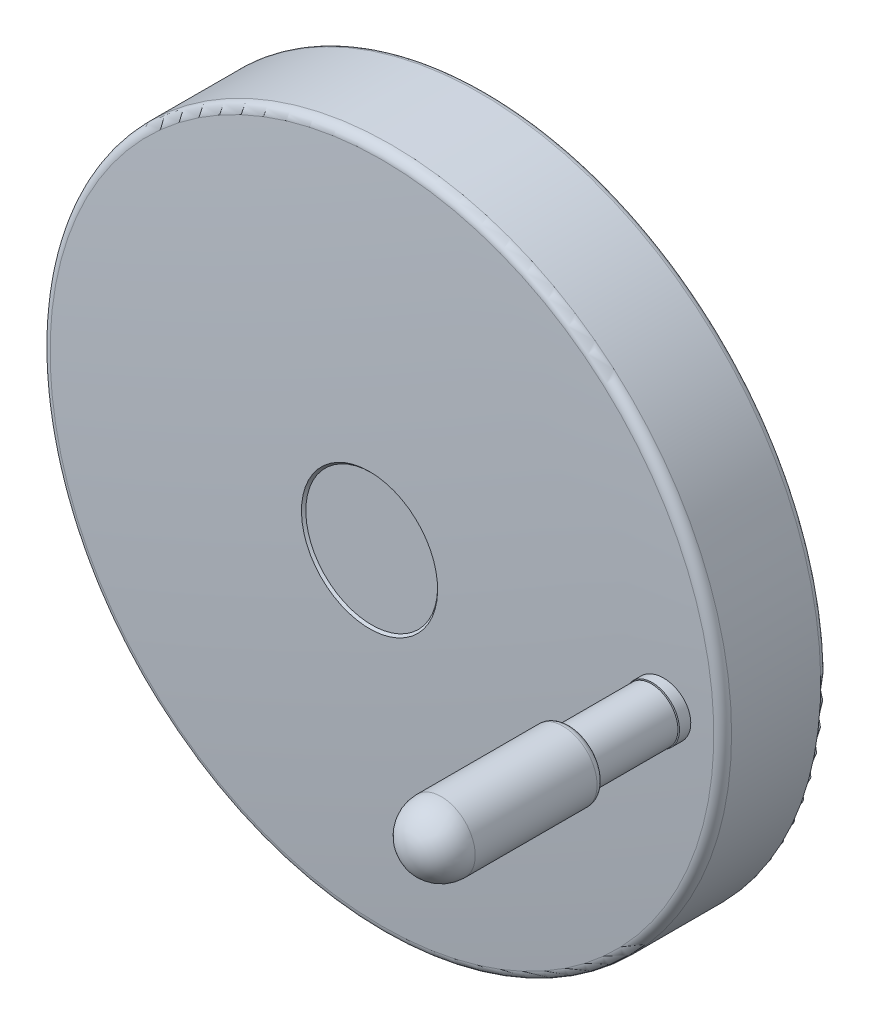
ISO-10303-21;
HEADER;
FILE_DESCRIPTION(('STEP AP214'),'2;1');
FILE_NAME('part.step','',(''),(''),'','','');
FILE_SCHEMA(('AUTOMOTIVE_DESIGN { 1 0 10303 214 1 1 1 1 }'));
ENDSEC;
DATA;
#1=APPLICATION_CONTEXT('core data for automotive mechanical design processes');
#2=APPLICATION_PROTOCOL_DEFINITION('international standard','automotive_design',2000,#1);
#3=PRODUCT_CONTEXT('',#1,'mechanical');
#4=PRODUCT('Part','Part','',(#3));
#5=PRODUCT_RELATED_PRODUCT_CATEGORY('part','',(#4));
#6=PRODUCT_DEFINITION_FORMATION('','',#4);
#7=PRODUCT_DEFINITION_CONTEXT('part definition',#1,'design');
#8=PRODUCT_DEFINITION('design','',#6,#7);
#9=PRODUCT_DEFINITION_SHAPE('','',#8);
#10=(LENGTH_UNIT() NAMED_UNIT(*) SI_UNIT(.MILLI.,.METRE.));
#11=(NAMED_UNIT(*) PLANE_ANGLE_UNIT() SI_UNIT($,.RADIAN.));
#12=(NAMED_UNIT(*) SI_UNIT($,.STERADIAN.) SOLID_ANGLE_UNIT());
#13=UNCERTAINTY_MEASURE_WITH_UNIT(LENGTH_MEASURE(1.E-05),#10,'distance_accuracy_value','');
#14=(GEOMETRIC_REPRESENTATION_CONTEXT(3) GLOBAL_UNCERTAINTY_ASSIGNED_CONTEXT((#13)) GLOBAL_UNIT_ASSIGNED_CONTEXT((#10,
#11,#12)) REPRESENTATION_CONTEXT('',''));
#15=CARTESIAN_POINT('',(0.,0.,0.));
#16=DIRECTION('',(0.,0.,1.));
#17=DIRECTION('',(1.,0.,0.));
#18=AXIS2_PLACEMENT_3D('',#15,#16,#17);
#19=CARTESIAN_POINT('',(0.,0.,60.));
#20=DIRECTION('',(0.,0.,1.));
#21=DIRECTION('',(0.,1.,0.));
#22=AXIS2_PLACEMENT_3D('',#19,#20,#21);
#23=PLANE('',#22);
#24=CARTESIAN_POINT('',(104.,0.,60.));
#25=DIRECTION('',(0.,0.,1.));
#26=DIRECTION('',(0.,1.,0.));
#27=AXIS2_PLACEMENT_3D('',#24,#25,#26);
#28=CIRCLE('',#27,7.3125);
#29=CARTESIAN_POINT('',(104.,7.31249999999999,60.));
#30=VERTEX_POINT('',#29);
#31=EDGE_CURVE('E791',#30,#30,#28,.T.);
#32=ORIENTED_EDGE('',*,*,#31,.F.);
#33=EDGE_LOOP('',(#32));
#34=FACE_BOUND('',#33,.T.);
#35=CARTESIAN_POINT('',(104.,0.,60.));
#36=DIRECTION('',(0.,0.,-1.));
#37=DIRECTION('',(0.,-1.,0.));
#38=AXIS2_PLACEMENT_3D('',#35,#36,#37);
#39=CIRCLE('',#38,10.);
#40=CARTESIAN_POINT('',(104.,-10.,60.));
#41=VERTEX_POINT('',#40);
#42=EDGE_CURVE('E813',#41,#41,#39,.T.);
#43=ORIENTED_EDGE('',*,*,#42,.F.);
#44=EDGE_LOOP('',(#43));
#45=FACE_BOUND('',#44,.T.);
#46=ADVANCED_FACE('F16',(#34,#45),#23,.T.);
#47=CARTESIAN_POINT('',(104.,0.,55.));
#48=DIRECTION('',(0.,0.,-1.));
#49=DIRECTION('',(0.,-1.,0.));
#50=AXIS2_PLACEMENT_3D('',#47,#48,#49);
#51=CYLINDRICAL_SURFACE('',#50,10.);
#52=CARTESIAN_POINT('',(94.,0.,57.174446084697));
#53=CARTESIAN_POINT('',(94.0000015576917,0.280279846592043,57.1744459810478));
#54=CARTESIAN_POINT('',(94.0117934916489,0.560610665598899,57.1736609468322));
#55=CARTESIAN_POINT('',(94.058891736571,1.11939313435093,57.1705254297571));
#56=CARTESIAN_POINT('',(94.0942096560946,1.39784378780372,57.1681741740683));
#57=CARTESIAN_POINT('',(94.1882041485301,1.95130459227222,57.1619165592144));
#58=CARTESIAN_POINT('',(94.2469246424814,2.22630726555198,57.158007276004));
#59=CARTESIAN_POINT('',(94.3873021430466,2.77037441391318,57.1486616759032));
#60=CARTESIAN_POINT('',(94.4689597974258,3.03943872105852,57.143225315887));
#61=CARTESIAN_POINT('',(94.6545371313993,3.56946677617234,57.1308704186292));
#62=CARTESIAN_POINT('',(94.7584364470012,3.83043768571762,57.123953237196));
#63=CARTESIAN_POINT('',(94.9877977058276,4.34269099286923,57.1086832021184));
#64=CARTESIAN_POINT('',(95.1132602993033,4.59397309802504,57.1003303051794));
#65=CARTESIAN_POINT('',(95.3847806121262,5.08494358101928,57.0822531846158));
#66=CARTESIAN_POINT('',(95.5308284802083,5.32463743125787,57.0725296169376));
#67=CARTESIAN_POINT('',(95.8425160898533,5.79086207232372,57.0517778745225));
#68=CARTESIAN_POINT('',(96.0081554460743,6.01739312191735,57.0407497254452));
#69=CARTESIAN_POINT('',(96.3580525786,6.45596042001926,57.0174535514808));
#70=CARTESIAN_POINT('',(96.5423321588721,6.66797919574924,57.0051840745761));
#71=CARTESIAN_POINT('',(96.9280302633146,7.07573325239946,56.9795036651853));
#72=CARTESIAN_POINT('',(97.1294488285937,7.27146849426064,56.9660927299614));
#73=CARTESIAN_POINT('',(97.5480084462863,7.64529574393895,56.9382236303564));
#74=CARTESIAN_POINT('',(97.7651509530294,7.82338611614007,56.9237653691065));
#75=CARTESIAN_POINT('',(98.2135974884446,8.16065314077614,56.8939054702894));
#76=CARTESIAN_POINT('',(98.4449015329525,8.31982977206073,56.8785038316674));
#77=CARTESIAN_POINT('',(98.9205175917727,8.61846087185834,56.8468339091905));
#78=CARTESIAN_POINT('',(99.1648553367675,8.75787417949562,56.8305639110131));
#79=CARTESIAN_POINT('',(99.6643643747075,9.01561137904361,56.7973019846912));
#80=CARTESIAN_POINT('',(99.9195356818,9.13393524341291,56.7803100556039));
#81=CARTESIAN_POINT('',(100.438899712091,9.34866442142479,56.7457248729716));
#82=CARTESIAN_POINT('',(100.703092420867,9.44506977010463,56.7281316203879));
#83=CARTESIAN_POINT('',(101.238626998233,9.61528794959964,56.6924684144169));
#84=CARTESIAN_POINT('',(101.509968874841,9.68910075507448,56.6743984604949));
#85=CARTESIAN_POINT('',(102.058421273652,9.81374094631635,56.6378737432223));
#86=CARTESIAN_POINT('',(102.335542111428,9.86452274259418,56.6194182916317));
#87=CARTESIAN_POINT('',(102.893065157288,9.94253111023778,56.5822881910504));
#88=CARTESIAN_POINT('',(103.173467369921,9.96975764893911,56.5636135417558));
#89=CARTESIAN_POINT('',(103.735565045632,10.0004649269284,56.5261774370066));
#90=CARTESIAN_POINT('',(104.017260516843,10.0039455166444,56.507415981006));
#91=CARTESIAN_POINT('',(104.579944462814,9.98713615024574,56.4699394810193));
#92=CARTESIAN_POINT('',(104.860932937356,9.9668461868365,56.4512244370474));
#93=CARTESIAN_POINT('',(105.420482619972,9.90260632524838,56.4139553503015));
#94=CARTESIAN_POINT('',(105.699041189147,9.85863333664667,56.3954014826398));
#95=CARTESIAN_POINT('',(106.251471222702,9.74732115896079,56.3586052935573));
#96=CARTESIAN_POINT('',(106.525342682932,9.67998194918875,56.3403629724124));
#97=CARTESIAN_POINT('',(107.066451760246,9.52240943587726,56.3043195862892));
#98=CARTESIAN_POINT('',(107.333689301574,9.43217587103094,56.2865185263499));
#99=CARTESIAN_POINT('',(107.859622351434,9.22944966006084,56.2514848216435));
#100=CARTESIAN_POINT('',(108.11831786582,9.11695702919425,56.2342521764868));
#101=CARTESIAN_POINT('',(108.625219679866,8.87055394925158,56.2004850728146));
#102=CARTESIAN_POINT('',(108.873430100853,8.73665201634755,56.1839503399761));
#103=CARTESIAN_POINT('',(109.357697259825,8.44834239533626,56.1516900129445));
#104=CARTESIAN_POINT('',(109.593753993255,8.29393469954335,56.1359644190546));
#105=CARTESIAN_POINT('',(110.052002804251,7.96571931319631,56.1054364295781));
#106=CARTESIAN_POINT('',(110.274196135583,7.79191338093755,56.0906339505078));
#107=CARTESIAN_POINT('',(110.703146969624,7.42612085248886,56.0620569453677));
#108=CARTESIAN_POINT('',(110.909904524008,7.23413431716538,56.0482824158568));
#109=CARTESIAN_POINT('',(111.306127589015,6.8337166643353,56.0218850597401));
#110=CARTESIAN_POINT('',(111.495624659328,6.62531691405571,56.0092601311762));
#111=CARTESIAN_POINT('',(111.856403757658,6.19323306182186,55.9852235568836));
#112=CARTESIAN_POINT('',(112.027685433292,5.96954866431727,55.9738119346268));
#113=CARTESIAN_POINT('',(112.350873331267,5.5083785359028,55.952279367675));
#114=CARTESIAN_POINT('',(112.502770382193,5.27088634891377,55.9421590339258));
#115=CARTESIAN_POINT('',(112.78599382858,4.78389520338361,55.9232887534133));
#116=CARTESIAN_POINT('',(112.917320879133,4.53439662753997,55.9145387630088));
#117=CARTESIAN_POINT('',(113.15830395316,4.02549747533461,55.8984825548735));
#118=CARTESIAN_POINT('',(113.267987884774,3.76611017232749,55.8911744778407));
#119=CARTESIAN_POINT('',(113.465102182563,3.23898344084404,55.8780409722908));
#120=CARTESIAN_POINT('',(113.552533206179,2.9712442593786,55.8722154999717));
#121=CARTESIAN_POINT('',(113.704368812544,2.42984126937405,55.8620987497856));
#122=CARTESIAN_POINT('',(113.768816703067,2.15618964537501,55.8578045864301));
#123=CARTESIAN_POINT('',(113.874427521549,1.60452257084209,55.8507677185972));
#124=CARTESIAN_POINT('',(113.915601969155,1.32650934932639,55.8480242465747));
#125=CARTESIAN_POINT('',(113.963322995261,0.873383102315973,55.8448445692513));
#126=CARTESIAN_POINT('',(113.977072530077,0.69900036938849,55.843928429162));
#127=CARTESIAN_POINT('',(113.995411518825,0.349751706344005,55.8427064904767));
#128=CARTESIAN_POINT('',(114.000000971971,0.174885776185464,55.8424006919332));
#129=CARTESIAN_POINT('',(113.999998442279,-0.280279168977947,55.8424008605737));
#130=CARTESIAN_POINT('',(113.988206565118,-0.560609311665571,55.8431865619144));
#131=CARTESIAN_POINT('',(113.941108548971,-1.11939042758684,55.8463247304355));
#132=CARTESIAN_POINT('',(113.905790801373,-1.39784040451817,55.8486779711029));
#133=CARTESIAN_POINT('',(113.811796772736,-1.95129985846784,55.8549408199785));
#134=CARTESIAN_POINT('',(113.753076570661,-2.2263018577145,55.8588533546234));
#135=CARTESIAN_POINT('',(113.612699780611,-2.77036766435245,55.868206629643));
#136=CARTESIAN_POINT('',(113.531042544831,-3.03943130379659,55.8736474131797));
#137=CARTESIAN_POINT('',(113.345466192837,-3.56945800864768,55.8860121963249));
#138=CARTESIAN_POINT('',(113.241567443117,-3.83042823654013,55.8929348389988));
#139=CARTESIAN_POINT('',(113.012207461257,-4.34268021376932,55.9082166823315));
#140=CARTESIAN_POINT('',(112.886745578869,-4.59396167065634,55.9165759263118));
#141=CARTESIAN_POINT('',(112.615226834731,-5.08493091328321,55.9346664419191));
#142=CARTESIAN_POINT('',(112.469179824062,-5.32462417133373,55.9443970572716));
#143=CARTESIAN_POINT('',(112.157494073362,-5.79084770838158,55.9651633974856));
#144=CARTESIAN_POINT('',(111.991855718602,-6.01737824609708,55.9761990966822));
#145=CARTESIAN_POINT('',(111.641960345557,-6.45594510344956,55.9995106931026));
#146=CARTESIAN_POINT('',(111.457681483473,-6.66796391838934,56.0117880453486));
#147=CARTESIAN_POINT('',(111.071984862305,-7.07571811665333,56.0374842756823));
#148=CARTESIAN_POINT('',(110.870567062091,-7.27145346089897,56.0509031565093));
#149=CARTESIAN_POINT('',(110.452009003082,-7.64528100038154,56.0787879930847));
#150=CARTESIAN_POINT('',(110.234867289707,-7.82337155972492,56.0932540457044));
#151=CARTESIAN_POINT('',(109.786422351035,-8.16063905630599,56.1231291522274));
#152=CARTESIAN_POINT('',(109.555119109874,-8.3198159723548,56.1385382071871));
#153=CARTESIAN_POINT('',(109.079503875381,-8.6184482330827,56.170222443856));
#154=CARTESIAN_POINT('',(108.835166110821,-8.75786235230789,56.1864993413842));
#155=CARTESIAN_POINT('',(108.335656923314,-9.01560115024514,56.219774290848));
#156=CARTESIAN_POINT('',(108.080485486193,-9.13392580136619,56.2367723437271));
#157=CARTESIAN_POINT('',(107.561121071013,-9.34865651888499,56.2713688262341));
#158=CARTESIAN_POINT('',(107.296928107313,-9.44506262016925,56.2889672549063));
#159=CARTESIAN_POINT('',(106.76139288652,-9.61528225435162,56.3246397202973));
#160=CARTESIAN_POINT('',(106.490050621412,-9.68909576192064,56.3427137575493));
#161=CARTESIAN_POINT('',(105.941597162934,-9.81373731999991,56.379245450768));
#162=CARTESIAN_POINT('',(105.664475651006,-9.86451976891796,56.3977037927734));
#163=CARTESIAN_POINT('',(105.106951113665,-9.94252932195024,56.4348383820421));
#164=CARTESIAN_POINT('',(104.826548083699,-9.96975639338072,56.4535146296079));
#165=CARTESIAN_POINT('',(104.264448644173,-10.0004645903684,56.4909525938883));
#166=CARTESIAN_POINT('',(103.98275222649,-10.0039455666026,56.5097143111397));
#167=CARTESIAN_POINT('',(103.420066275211,-9.98713680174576,56.547189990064));
#168=CARTESIAN_POINT('',(103.13907674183,-9.96684705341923,56.5659039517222));
#169=CARTESIAN_POINT('',(102.579525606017,-9.90260751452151,56.6031695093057));
#170=CARTESIAN_POINT('',(102.300966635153,-9.85863469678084,56.6217209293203));
#171=CARTESIAN_POINT('',(101.748535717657,-9.74732277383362,56.6585109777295));
#172=CARTESIAN_POINT('',(101.474663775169,-9.67998364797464,56.6767496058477));
#173=CARTESIAN_POINT('',(100.933553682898,-9.52241120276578,56.7127844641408));
#174=CARTESIAN_POINT('',(100.666315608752,-9.43217762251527,56.7305806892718));
#175=CARTESIAN_POINT('',(100.140381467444,-9.2294512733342,56.7656037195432));
#176=CARTESIAN_POINT('',(99.8816853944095,-9.11695851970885,56.7828305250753));
#177=CARTESIAN_POINT('',(99.374783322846,-8.87055550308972,56.8165850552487));
#178=CARTESIAN_POINT('',(99.1265731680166,-8.73665382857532,56.8331130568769));
#179=CARTESIAN_POINT('',(98.6423064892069,-8.44834476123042,56.8653592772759));
#180=CARTESIAN_POINT('',(98.4062499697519,-8.29393736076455,56.8810774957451));
#181=CARTESIAN_POINT('',(97.948001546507,-7.96572260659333,56.9115902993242));
#182=CARTESIAN_POINT('',(97.7258083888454,-7.7919170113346,56.9263849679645));
#183=CARTESIAN_POINT('',(97.2968578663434,-7.42612520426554,56.9549461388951));
#184=CARTESIAN_POINT('',(97.0901004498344,-7.23413905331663,56.9687126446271));
#185=CARTESIAN_POINT('',(96.6938778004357,-6.83372240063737,56.9950939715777));
#186=CARTESIAN_POINT('',(96.5043809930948,-6.62532328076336,57.0077108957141));
#187=CARTESIAN_POINT('',(96.1436023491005,-6.1932407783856,57.031731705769));
#188=CARTESIAN_POINT('',(95.9723208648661,-5.96955710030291,57.043135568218));
#189=CARTESIAN_POINT('',(95.6491332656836,-5.50838850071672,57.0646530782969));
#190=CARTESIAN_POINT('',(95.497236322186,-5.27089712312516,57.0747661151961));
#191=CARTESIAN_POINT('',(95.2140129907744,-4.78390768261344,57.0936224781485));
#192=CARTESIAN_POINT('',(95.0826859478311,-4.53441000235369,57.1023658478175));
#193=CARTESIAN_POINT('',(94.8417024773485,-4.02551209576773,57.1184097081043));
#194=CARTESIAN_POINT('',(94.7320181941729,-3.7661251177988,57.1257120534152));
#195=CARTESIAN_POINT('',(94.5349031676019,-3.23899905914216,57.1388351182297));
#196=CARTESIAN_POINT('',(94.4474717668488,-2.97126022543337,57.1446558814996));
#197=CARTESIAN_POINT('',(94.2956353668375,-2.42985793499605,57.1547643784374));
#198=CARTESIAN_POINT('',(94.2311870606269,-2.15620666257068,57.1590549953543));
#199=CARTESIAN_POINT('',(94.1255753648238,-1.60454028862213,57.1660860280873));
#200=CARTESIAN_POINT('',(94.084400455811,-1.32652741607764,57.1688272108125));
#201=CARTESIAN_POINT('',(94.0366782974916,-0.873398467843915,57.17200426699));
#202=CARTESIAN_POINT('',(94.0229282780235,-0.699012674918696,57.1729196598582));
#203=CARTESIAN_POINT('',(94.0045886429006,-0.349757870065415,57.1741406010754));
#204=CARTESIAN_POINT('',(93.9999990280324,-0.174888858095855,57.1744461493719));
#205=CARTESIAN_POINT('',(94.,0.,57.174446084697));
#206=B_SPLINE_CURVE_WITH_KNOTS('',3,(#52,#53,#54,#55,#56,#57,#58,#59,#60,#61,#62,#63,#64,#65,
#66,#67,#68,#69,#70,#71,#72,#73,#74,#75,#76,#77,#78,#79,#80,#81,#82,#83,#84,#85,#86,#87,#88,#89,
#90,#91,#92,#93,#94,#95,#96,#97,#98,#99,#100,#101,#102,#103,#104,#105,#106,#107,#108,#109,#110,
#111,#112,#113,#114,#115,#116,#117,#118,#119,#120,#121,#122,#123,#124,#125,#126,#127,#128,#129,
#130,#131,#132,#133,#134,#135,#136,#137,#138,#139,#140,#141,#142,#143,#144,#145,#146,#147,#148,
#149,#150,#151,#152,#153,#154,#155,#156,#157,#158,#159,#160,#161,#162,#163,#164,#165,#166,#167,
#168,#169,#170,#171,#172,#173,#174,#175,#176,#177,#178,#179,#180,#181,#182,#183,#184,#185,#186,
#187,#188,#189,#190,#191,#192,#193,#194,#195,#196,#197,#198,#199,#200,#201,#202,#203,#204,#205),
.UNSPECIFIED.,.T.,.F.,(4,2,2,2,2,2,2,2,2,2,2,2,2,2,2,2,2,2,2,2,2,2,2,2,2,2,2,2,2,2,2,2,2,2,2,2,
2,2,2,2,2,2,2,2,2,2,2,2,2,2,2,2,2,2,2,2,2,2,2,2,2,2,2,2,2,2,2,2,2,2,2,2,2,2,2,2,4),(0.,
0.840679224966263,1.68177357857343,2.52445395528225,3.3671581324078,4.20909402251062,
5.05105530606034,5.8926150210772,6.73415818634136,7.57669736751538,8.41923856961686,
9.26185779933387,10.1044779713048,10.9488280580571,11.7931792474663,12.6375290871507,
13.4818798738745,14.3278948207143,15.1739109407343,16.0199323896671,16.8659540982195,
17.7128021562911,18.5596509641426,19.4065094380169,20.2533673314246,21.0998891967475,
21.9464113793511,22.7928568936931,23.6392995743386,24.4841621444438,25.3290410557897,
26.1743182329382,27.0195684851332,27.8637215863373,28.7078497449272,29.5503787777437,
30.3924904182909,30.9170476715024,31.4416049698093,32.2822821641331,33.1233744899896,
33.9660528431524,34.8087549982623,35.6506887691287,36.4926479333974,37.3342055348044,
38.175746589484,39.0182854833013,39.8608263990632,40.7034453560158,41.5460652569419,
42.390417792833,43.2347714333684,44.0791237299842,44.9234769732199,45.7694948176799,
46.6155138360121,47.4615381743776,48.3075627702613,49.1544114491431,50.0012608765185,
50.8481199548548,51.6949784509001,52.5414980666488,53.3880179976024,54.234461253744,
55.0809016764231,55.9257612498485,56.7706371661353,57.6159113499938,58.4611586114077,
59.3053107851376,60.1494380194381,60.9919661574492,61.8340769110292,62.3586434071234,
62.8832099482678),.UNSPECIFIED.);
#207=CARTESIAN_POINT('',(94.,0.,57.174446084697));
#208=VERTEX_POINT('',#207);
#209=EDGE_CURVE('E795',#208,#208,#206,.T.);
#210=ORIENTED_EDGE('',*,*,#209,.F.);
#211=EDGE_LOOP('',(#210));
#212=FACE_BOUND('',#211,.T.);
#213=ORIENTED_EDGE('',*,*,#42,.T.);
#214=EDGE_LOOP('',(#213));
#215=FACE_BOUND('',#214,.T.);
#216=ADVANCED_FACE('F636',(#212,#215),#51,.T.);
#217=CARTESIAN_POINT('',(0.,0.,-1504.99999999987));
#218=DIRECTION('',(-1.,0.,0.));
#219=DIRECTION('',(0.,0.,1.));
#220=AXIS2_PLACEMENT_3D('',#217,#218,#219);
#221=SPHERICAL_SURFACE('',#220,1564.99999999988);
#222=CARTESIAN_POINT('',(0.,0.,55.2480513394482));
#223=DIRECTION('',(0.,0.,1.));
#224=DIRECTION('',(0.,1.,0.));
#225=AXIS2_PLACEMENT_3D('',#222,#223,#224);
#226=CIRCLE('',#225,121.864754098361);
#227=CARTESIAN_POINT('',(0.,121.864754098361,55.2480513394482));
#228=VERTEX_POINT('',#227);
#229=EDGE_CURVE('E788',#228,#228,#226,.T.);
#230=ORIENTED_EDGE('',*,*,#229,.T.);
#231=EDGE_LOOP('',(#230));
#232=FACE_BOUND('',#231,.T.);
#233=CARTESIAN_POINT('',(0.,0.,59.8003067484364));
#234=DIRECTION('',(0.,0.,1.));
#235=DIRECTION('',(0.,1.,0.));
#236=AXIS2_PLACEMENT_3D('',#233,#234,#235);
#237=CIRCLE('',#236,25.);
#238=CARTESIAN_POINT('',(0.,25.,59.8003067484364));
#239=VERTEX_POINT('',#238);
#240=EDGE_CURVE('E792',#239,#239,#237,.F.);
#241=ORIENTED_EDGE('',*,*,#240,.T.);
#242=EDGE_LOOP('',(#241));
#243=FACE_BOUND('',#242,.T.);
#244=ORIENTED_EDGE('',*,*,#209,.T.);
#245=EDGE_LOOP('',(#244));
#246=FACE_BOUND('',#245,.T.);
#247=ADVANCED_FACE('F627',(#232,#243,#246),#221,.T.);
#248=CARTESIAN_POINT('',(0.,0.,51.8583750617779));
#249=DIRECTION('',(0.,0.,1.));
#250=DIRECTION('',(0.,1.,0.));
#251=AXIS2_PLACEMENT_3D('',#248,#249,#250);
#252=TOROIDAL_SURFACE('',#251,121.6,3.39999999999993);
#253=CARTESIAN_POINT('',(0.,0.,51.8583750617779));
#254=DIRECTION('',(0.,0.,1.));
#255=DIRECTION('',(0.,1.,0.));
#256=AXIS2_PLACEMENT_3D('',#253,#254,#255);
#257=CIRCLE('',#256,125.);
#258=CARTESIAN_POINT('',(0.,125.,51.8583750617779));
#259=VERTEX_POINT('',#258);
#260=EDGE_CURVE('E801',#259,#259,#257,.T.);
#261=ORIENTED_EDGE('',*,*,#260,.T.);
#262=EDGE_LOOP('',(#261));
#263=FACE_BOUND('',#262,.T.);
#264=ORIENTED_EDGE('',*,*,#229,.F.);
#265=EDGE_LOOP('',(#264));
#266=FACE_BOUND('',#265,.T.);
#267=ADVANCED_FACE('F618',(#263,#266),#252,.T.);
#268=CARTESIAN_POINT('',(0.,0.,59.8003067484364));
#269=DIRECTION('',(0.,0.,1.));
#270=DIRECTION('',(0.,1.,0.));
#271=AXIS2_PLACEMENT_3D('',#268,#269,#270);
#272=CONICAL_SURFACE('',#271,25.,0.785398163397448);
#273=CARTESIAN_POINT('',(0.,0.,59.));
#274=DIRECTION('',(0.,0.,1.));
#275=DIRECTION('',(0.,1.,0.));
#276=AXIS2_PLACEMENT_3D('',#273,#274,#275);
#277=CIRCLE('',#276,24.1996932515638);
#278=CARTESIAN_POINT('',(0.,24.1996932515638,59.));
#279=VERTEX_POINT('',#278);
#280=EDGE_CURVE('E802',#279,#279,#277,.T.);
#281=ORIENTED_EDGE('',*,*,#280,.F.);
#282=EDGE_LOOP('',(#281));
#283=FACE_BOUND('',#282,.T.);
#284=ORIENTED_EDGE('',*,*,#240,.F.);
#285=EDGE_LOOP('',(#284));
#286=FACE_BOUND('',#285,.T.);
#287=ADVANCED_FACE('F609',(#283,#286),#272,.F.);
#288=CARTESIAN_POINT('',(0.,0.,35.491687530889));
#289=DIRECTION('',(0.,0.,-1.));
#290=DIRECTION('',(0.,-1.,0.));
#291=AXIS2_PLACEMENT_3D('',#288,#289,#290);
#292=CYLINDRICAL_SURFACE('',#291,125.);
#293=CARTESIAN_POINT('',(0.,0.,19.125));
#294=DIRECTION('',(0.,0.,-1.));
#295=DIRECTION('',(0.,-1.,0.));
#296=AXIS2_PLACEMENT_3D('',#293,#294,#295);
#297=CIRCLE('',#296,125.);
#298=CARTESIAN_POINT('',(0.,-125.,19.125));
#299=VERTEX_POINT('',#298);
#300=EDGE_CURVE('E699',#299,#299,#297,.F.);
#301=ORIENTED_EDGE('',*,*,#300,.T.);
#302=EDGE_LOOP('',(#301));
#303=FACE_BOUND('',#302,.T.);
#304=ORIENTED_EDGE('',*,*,#260,.F.);
#305=EDGE_LOOP('',(#304));
#306=FACE_BOUND('',#305,.T.);
#307=ADVANCED_FACE('F600',(#303,#306),#292,.T.);
#308=CARTESIAN_POINT('',(-12.0998466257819,0.,59.));
#309=DIRECTION('',(0.,0.,1.));
#310=DIRECTION('',(0.,1.,0.));
#311=AXIS2_PLACEMENT_3D('',#308,#309,#310);
#312=PLANE('',#311);
#313=ORIENTED_EDGE('',*,*,#280,.T.);
#314=EDGE_LOOP('',(#313));
#315=FACE_BOUND('',#314,.T.);
#316=ADVANCED_FACE('F591',(#315),#312,.T.);
#317=CARTESIAN_POINT('',(0.,0.,19.125));
#318=DIRECTION('',(0.,0.,1.));
#319=DIRECTION('',(0.,1.,0.));
#320=AXIS2_PLACEMENT_3D('',#317,#318,#319);
#321=TOROIDAL_SURFACE('',#320,122.875,2.125);
#322=ORIENTED_EDGE('',*,*,#300,.F.);
#323=EDGE_LOOP('',(#322));
#324=FACE_BOUND('',#323,.T.);
#325=CARTESIAN_POINT('',(0.,0.,17.));
#326=DIRECTION('',(0.,0.,1.));
#327=DIRECTION('',(0.,-1.,0.));
#328=AXIS2_PLACEMENT_3D('',#325,#326,#327);
#329=CIRCLE('',#328,122.875);
#330=CARTESIAN_POINT('',(0.,-122.875,17.));
#331=VERTEX_POINT('',#330);
#332=CARTESIAN_POINT('',(0.,122.875,17.));
#333=VERTEX_POINT('',#332);
#334=EDGE_CURVE('E724',#331,#333,#329,.T.);
#335=ORIENTED_EDGE('',*,*,#334,.T.);
#336=CARTESIAN_POINT('',(0.,0.,17.));
#337=DIRECTION('',(0.,0.,1.));
#338=DIRECTION('',(0.,1.,0.));
#339=AXIS2_PLACEMENT_3D('',#336,#337,#338);
#340=CIRCLE('',#339,122.875);
#341=CARTESIAN_POINT('',(-122.875,0.,17.));
#342=VERTEX_POINT('',#341);
#343=EDGE_CURVE('E744',#333,#342,#340,.T.);
#344=ORIENTED_EDGE('',*,*,#343,.T.);
#345=CARTESIAN_POINT('',(0.,0.,17.));
#346=DIRECTION('',(0.,0.,1.));
#347=DIRECTION('',(-1.,0.,0.));
#348=AXIS2_PLACEMENT_3D('',#345,#346,#347);
#349=CIRCLE('',#348,122.875);
#350=EDGE_CURVE('E36',#342,#331,#349,.T.);
#351=ORIENTED_EDGE('',*,*,#350,.T.);
#352=EDGE_LOOP('',(#335,#344,#351));
#353=FACE_BOUND('',#352,.T.);
#354=ADVANCED_FACE('F582',(#324,#353),#321,.T.);
#355=CARTESIAN_POINT('',(-121.4375,0.,17.));
#356=DIRECTION('',(0.,0.,-1.));
#357=DIRECTION('',(0.,-1.,0.));
#358=AXIS2_PLACEMENT_3D('',#355,#356,#357);
#359=PLANE('',#358);
#360=CARTESIAN_POINT('',(0.,0.,17.));
#361=DIRECTION('',(0.,0.,-1.));
#362=DIRECTION('',(0.,-1.,0.));
#363=AXIS2_PLACEMENT_3D('',#360,#361,#362);
#364=CIRCLE('',#363,120.);
#365=CARTESIAN_POINT('',(0.,-120.,17.));
#366=VERTEX_POINT('',#365);
#367=EDGE_CURVE('E745',#366,#366,#364,.F.);
#368=ORIENTED_EDGE('',*,*,#367,.T.);
#369=EDGE_LOOP('',(#368));
#370=FACE_BOUND('',#369,.T.);
#371=ORIENTED_EDGE('',*,*,#343,.F.);
#372=ORIENTED_EDGE('',*,*,#334,.F.);
#373=ORIENTED_EDGE('',*,*,#350,.F.);
#374=EDGE_LOOP('',(#371,#372,#373));
#375=FACE_BOUND('',#374,.T.);
#376=ADVANCED_FACE('F574',(#370,#375),#359,.T.);
#377=CARTESIAN_POINT('',(0.,0.,20.5));
#378=DIRECTION('',(0.,0.,-1.));
#379=DIRECTION('',(0.,-1.,0.));
#380=AXIS2_PLACEMENT_3D('',#377,#378,#379);
#381=CYLINDRICAL_SURFACE('',#380,120.);
#382=ORIENTED_EDGE('',*,*,#367,.F.);
#383=EDGE_LOOP('',(#382));
#384=FACE_BOUND('',#383,.T.);
#385=CARTESIAN_POINT('',(0.,0.,24.));
#386=DIRECTION('',(0.,0.,-1.));
#387=DIRECTION('',(0.,-1.,0.));
#388=AXIS2_PLACEMENT_3D('',#385,#386,#387);
#389=CIRCLE('',#388,120.);
#390=CARTESIAN_POINT('',(0.,-120.,24.));
#391=VERTEX_POINT('',#390);
#392=EDGE_CURVE('E749',#391,#391,#389,.T.);
#393=ORIENTED_EDGE('',*,*,#392,.F.);
#394=EDGE_LOOP('',(#393));
#395=FACE_BOUND('',#394,.T.);
#396=ADVANCED_FACE('F565',(#384,#395),#381,.F.);
#397=CARTESIAN_POINT('',(104.,0.,45.));
#398=DIRECTION('',(0.,0.,1.));
#399=DIRECTION('',(0.,1.,0.));
#400=AXIS2_PLACEMENT_3D('',#397,#398,#399);
#401=CYLINDRICAL_SURFACE('',#400,4.188);
#402=CARTESIAN_POINT('',(104.,0.,43.1079999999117));
#403=DIRECTION('',(0.,0.,1.));
#404=DIRECTION('',(0.,1.,0.));
#405=AXIS2_PLACEMENT_3D('',#402,#403,#404);
#406=CIRCLE('',#405,4.188);
#407=CARTESIAN_POINT('',(104.,4.18799999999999,43.1079999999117));
#408=VERTEX_POINT('',#407);
#409=EDGE_CURVE('E9',#408,#408,#406,.T.);
#410=ORIENTED_EDGE('',*,*,#409,.T.);
#411=EDGE_LOOP('',(#410));
#412=FACE_BOUND('',#411,.T.);
#413=CARTESIAN_POINT('',(104.,0.,30.812));
#414=DIRECTION('',(0.,0.,1.));
#415=DIRECTION('',(0.,1.,0.));
#416=AXIS2_PLACEMENT_3D('',#413,#414,#415);
#417=CIRCLE('',#416,4.188);
#418=CARTESIAN_POINT('',(104.,4.188,30.812));
#419=VERTEX_POINT('',#418);
#420=EDGE_CURVE('E746',#419,#419,#417,.T.);
#421=ORIENTED_EDGE('',*,*,#420,.F.);
#422=EDGE_LOOP('',(#421));
#423=FACE_BOUND('',#422,.T.);
#424=ADVANCED_FACE('F555',(#412,#423),#401,.F.);
#425=CARTESIAN_POINT('',(104.,0.,29.9999999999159));
#426=DIRECTION('',(0.,0.,-1.));
#427=DIRECTION('',(0.,-1.,0.));
#428=AXIS2_PLACEMENT_3D('',#425,#426,#427);
#429=CONICAL_SURFACE('',#428,5.00000000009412,0.785398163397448);
#430=ORIENTED_EDGE('',*,*,#420,.T.);
#431=EDGE_LOOP('',(#430));
#432=FACE_BOUND('',#431,.T.);
#433=CARTESIAN_POINT('',(104.,0.,29.9999999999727));
#434=DIRECTION('',(0.,0.,-1.));
#435=DIRECTION('',(0.,-1.,0.));
#436=AXIS2_PLACEMENT_3D('',#433,#434,#435);
#437=CIRCLE('',#436,5.00000000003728);
#438=CARTESIAN_POINT('',(104.,-5.00000000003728,29.9999999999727));
#439=VERTEX_POINT('',#438);
#440=EDGE_CURVE('E752',#439,#439,#437,.F.);
#441=ORIENTED_EDGE('',*,*,#440,.F.);
#442=EDGE_LOOP('',(#441));
#443=FACE_BOUND('',#442,.T.);
#444=ADVANCED_FACE('F547',(#432,#443),#429,.F.);
#445=CARTESIAN_POINT('',(109.5,0.,30.));
#446=DIRECTION('',(0.,0.,1.));
#447=DIRECTION('',(0.,1.,0.));
#448=AXIS2_PLACEMENT_3D('',#445,#446,#447);
#449=PLANE('',#448);
#450=ORIENTED_EDGE('',*,*,#440,.T.);
#451=EDGE_LOOP('',(#450));
#452=FACE_BOUND('',#451,.T.);
#453=CARTESIAN_POINT('',(104.,0.,30.));
#454=DIRECTION('',(0.,0.,1.));
#455=DIRECTION('',(0.,1.,0.));
#456=AXIS2_PLACEMENT_3D('',#453,#454,#455);
#457=CIRCLE('',#456,6.);
#458=CARTESIAN_POINT('',(104.,6.,30.));
#459=VERTEX_POINT('',#458);
#460=EDGE_CURVE('E756',#459,#459,#457,.T.);
#461=ORIENTED_EDGE('',*,*,#460,.F.);
#462=EDGE_LOOP('',(#461));
#463=FACE_BOUND('',#462,.T.);
#464=ADVANCED_FACE('F539',(#452,#463),#449,.F.);
#465=CARTESIAN_POINT('',(104.,0.,15.));
#466=DIRECTION('',(0.,0.,1.));
#467=DIRECTION('',(0.,1.,0.));
#468=AXIS2_PLACEMENT_3D('',#465,#466,#467);
#469=CYLINDRICAL_SURFACE('',#468,6.);
#470=CARTESIAN_POINT('',(104.,0.,24.));
#471=DIRECTION('',(0.,0.,1.));
#472=DIRECTION('',(0.,1.,0.));
#473=AXIS2_PLACEMENT_3D('',#470,#471,#472);
#474=CIRCLE('',#473,6.);
#475=CARTESIAN_POINT('',(104.,6.,24.));
#476=VERTEX_POINT('',#475);
#477=EDGE_CURVE('E760',#476,#476,#474,.T.);
#478=ORIENTED_EDGE('',*,*,#477,.F.);
#479=EDGE_LOOP('',(#478));
#480=FACE_BOUND('',#479,.T.);
#481=ORIENTED_EDGE('',*,*,#460,.T.);
#482=EDGE_LOOP('',(#481));
#483=FACE_BOUND('',#482,.T.);
#484=ADVANCED_FACE('F530',(#480,#483),#469,.F.);
#485=CARTESIAN_POINT('',(-100.329277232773,0.,24.));
#486=DIRECTION('',(0.,0.,-1.));
#487=DIRECTION('',(0.,-1.,0.));
#488=AXIS2_PLACEMENT_3D('',#485,#486,#487);
#489=PLANE('',#488);
#490=CARTESIAN_POINT('',(0.,0.,24.));
#491=DIRECTION('',(0.,0.,-1.));
#492=DIRECTION('',(0.,-1.,0.));
#493=AXIS2_PLACEMENT_3D('',#490,#491,#492);
#494=CIRCLE('',#493,86.);
#495=CARTESIAN_POINT('',(0.,-86.,24.));
#496=VERTEX_POINT('',#495);
#497=EDGE_CURVE('E764',#496,#496,#494,.F.);
#498=ORIENTED_EDGE('',*,*,#497,.T.);
#499=EDGE_LOOP('',(#498));
#500=FACE_BOUND('',#499,.T.);
#501=CARTESIAN_POINT('',(0.,0.,24.));
#502=DIRECTION('',(0.,0.,1.));
#503=DIRECTION('',(0.,1.,0.));
#504=AXIS2_PLACEMENT_3D('',#501,#502,#503);
#505=CIRCLE('',#504,114.658554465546);
#506=CARTESIAN_POINT('',(0.,114.658554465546,24.));
#507=VERTEX_POINT('',#506);
#508=EDGE_CURVE('E831',#507,#507,#505,.T.);
#509=ORIENTED_EDGE('',*,*,#508,.F.);
#510=EDGE_LOOP('',(#509));
#511=FACE_BOUND('',#510,.T.);
#512=ORIENTED_EDGE('',*,*,#477,.T.);
#513=EDGE_LOOP('',(#512));
#514=FACE_BOUND('',#513,.T.);
#515=ADVANCED_FACE('F521',(#500,#511,#514),#489,.T.);
#516=CARTESIAN_POINT('',(0.,0.,24.));
#517=DIRECTION('',(0.,0.,-1.));
#518=DIRECTION('',(0.,-1.,0.));
#519=AXIS2_PLACEMENT_3D('',#516,#517,#518);
#520=CONICAL_SURFACE('',#519,86.,0.785398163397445);
#521=ORIENTED_EDGE('',*,*,#497,.F.);
#522=EDGE_LOOP('',(#521));
#523=FACE_BOUND('',#522,.T.);
#524=CARTESIAN_POINT('',(0.,0.,25.));
#525=DIRECTION('',(0.,0.,-1.));
#526=DIRECTION('',(-1.,0.,0.));
#527=AXIS2_PLACEMENT_3D('',#524,#525,#526);
#528=CIRCLE('',#527,85.);
#529=CARTESIAN_POINT('',(-85.,0.,25.));
#530=VERTEX_POINT('',#529);
#531=EDGE_CURVE('E761',#530,#530,#528,.T.);
#532=ORIENTED_EDGE('',*,*,#531,.F.);
#533=EDGE_LOOP('',(#532));
#534=FACE_BOUND('',#533,.T.);
#535=ADVANCED_FACE('F512',(#523,#534),#520,.F.);
#536=CARTESIAN_POINT('',(0.,0.,42.1903056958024));
#537=DIRECTION('',(0.,0.,1.));
#538=DIRECTION('',(0.,1.,0.));
#539=AXIS2_PLACEMENT_3D('',#536,#537,#538);
#540=CONICAL_SURFACE('',#539,116.25,0.0872664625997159);
#541=CARTESIAN_POINT('',(0.,0.,42.1903056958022));
#542=DIRECTION('',(0.,0.,-1.));
#543=DIRECTION('',(-1.,0.,0.));
#544=AXIS2_PLACEMENT_3D('',#541,#542,#543);
#545=CIRCLE('',#544,116.25);
#546=CARTESIAN_POINT('',(-116.25,0.,42.1903056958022));
#547=VERTEX_POINT('',#546);
#548=EDGE_CURVE('E757',#547,#547,#545,.T.);
#549=ORIENTED_EDGE('',*,*,#548,.T.);
#550=EDGE_LOOP('',(#549));
#551=FACE_BOUND('',#550,.T.);
#552=ORIENTED_EDGE('',*,*,#508,.T.);
#553=EDGE_LOOP('',(#552));
#554=FACE_BOUND('',#553,.T.);
#555=ADVANCED_FACE('F504',(#551,#554),#540,.T.);
#556=CARTESIAN_POINT('',(0.,0.,33.3116824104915));
#557=DIRECTION('',(0.,0.,-1.));
#558=DIRECTION('',(0.,-1.,0.));
#559=AXIS2_PLACEMENT_3D('',#556,#557,#558);
#560=CYLINDRICAL_SURFACE('',#559,85.);
#561=ORIENTED_EDGE('',*,*,#531,.T.);
#562=EDGE_LOOP('',(#561));
#563=FACE_BOUND('',#562,.T.);
#564=CARTESIAN_POINT('',(0.,0.,41.6233648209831));
#565=DIRECTION('',(0.,0.,-1.));
#566=DIRECTION('',(0.,-1.,0.));
#567=AXIS2_PLACEMENT_3D('',#564,#565,#566);
#568=CIRCLE('',#567,85.);
#569=CARTESIAN_POINT('',(0.,-85.,41.6233648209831));
#570=VERTEX_POINT('',#569);
#571=EDGE_CURVE('E765',#570,#570,#568,.T.);
#572=ORIENTED_EDGE('',*,*,#571,.F.);
#573=EDGE_LOOP('',(#572));
#574=FACE_BOUND('',#573,.T.);
#575=ADVANCED_FACE('F495',(#563,#574),#560,.F.);
#576=CARTESIAN_POINT('',(0.,0.,42.));
#577=DIRECTION('',(0.,0.,-1.));
#578=DIRECTION('',(0.,-1.,0.));
#579=AXIS2_PLACEMENT_3D('',#576,#577,#578);
#580=CONICAL_SURFACE('',#579,118.425204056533,1.48352986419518);
#581=CARTESIAN_POINT('',(0.,0.,42.));
#582=DIRECTION('',(0.,0.,-1.));
#583=DIRECTION('',(-1.,0.,0.));
#584=AXIS2_PLACEMENT_3D('',#581,#582,#583);
#585=CIRCLE('',#584,118.425204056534);
#586=CARTESIAN_POINT('',(-118.425204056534,0.,42.0000000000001));
#587=VERTEX_POINT('',#586);
#588=EDGE_CURVE('E753',#587,#587,#585,.T.);
#589=ORIENTED_EDGE('',*,*,#588,.T.);
#590=EDGE_LOOP('',(#589));
#591=FACE_BOUND('',#590,.T.);
#592=ORIENTED_EDGE('',*,*,#548,.F.);
#593=EDGE_LOOP('',(#592));
#594=FACE_BOUND('',#593,.T.);
#595=ADVANCED_FACE('F485',(#591,#594),#580,.F.);
#596=CARTESIAN_POINT('',(0.,0.,41.6233648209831));
#597=DIRECTION('',(0.,0.,1.));
#598=DIRECTION('',(0.,1.,0.));
#599=AXIS2_PLACEMENT_3D('',#596,#597,#598);
#600=TOROIDAL_SURFACE('',#599,82.1666666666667,2.83333333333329);
#601=CARTESIAN_POINT('',(0.,0.,44.4136534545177));
#602=DIRECTION('',(0.,0.,1.));
#603=DIRECTION('',(0.,1.,0.));
#604=AXIS2_PLACEMENT_3D('',#601,#602,#603);
#605=CIRCLE('',#604,81.6746634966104);
#606=CARTESIAN_POINT('',(0.,81.6746634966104,44.4136534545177));
#607=VERTEX_POINT('',#606);
#608=EDGE_CURVE('E768',#607,#607,#605,.F.);
#609=ORIENTED_EDGE('',*,*,#608,.F.);
#610=EDGE_LOOP('',(#609));
#611=FACE_BOUND('',#610,.T.);
#612=ORIENTED_EDGE('',*,*,#571,.T.);
#613=EDGE_LOOP('',(#612));
#614=FACE_BOUND('',#613,.T.);
#615=ADVANCED_FACE('F475',(#611,#614),#600,.F.);
#616=CARTESIAN_POINT('',(0.,0.,24.));
#617=DIRECTION('',(0.,0.,-1.));
#618=DIRECTION('',(0.,-1.,0.));
#619=AXIS2_PLACEMENT_3D('',#616,#617,#618);
#620=CONICAL_SURFACE('',#619,120.,0.0872664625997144);
#621=ORIENTED_EDGE('',*,*,#392,.T.);
#622=EDGE_LOOP('',(#621));
#623=FACE_BOUND('',#622,.T.);
#624=ORIENTED_EDGE('',*,*,#588,.F.);
#625=EDGE_LOOP('',(#624));
#626=FACE_BOUND('',#625,.T.);
#627=ADVANCED_FACE('F465',(#623,#626),#620,.F.);
#628=CARTESIAN_POINT('',(0.,0.,44.4136534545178));
#629=DIRECTION('',(0.,0.,1.));
#630=DIRECTION('',(0.,1.,0.));
#631=AXIS2_PLACEMENT_3D('',#628,#629,#630);
#632=CONICAL_SURFACE('',#631,81.6746634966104,1.39626340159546);
#633=CARTESIAN_POINT('',(0.,0.,35.285229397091));
#634=DIRECTION('',(0.,0.,1.));
#635=DIRECTION('',(-1.,0.,0.));
#636=AXIS2_PLACEMENT_3D('',#633,#634,#635);
#637=CIRCLE('',#636,29.9047980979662);
#638=CARTESIAN_POINT('',(-29.9047980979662,0.,35.285229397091));
#639=VERTEX_POINT('',#638);
#640=EDGE_CURVE('E775',#639,#639,#637,.T.);
#641=ORIENTED_EDGE('',*,*,#640,.T.);
#642=EDGE_LOOP('',(#641));
#643=FACE_BOUND('',#642,.T.);
#644=ORIENTED_EDGE('',*,*,#608,.T.);
#645=EDGE_LOOP('',(#644));
#646=FACE_BOUND('',#645,.T.);
#647=ADVANCED_FACE('F455',(#643,#646),#632,.T.);
#648=CARTESIAN_POINT('',(0.,0.,33.6110562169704));
#649=DIRECTION('',(0.,0.,1.));
#650=DIRECTION('',(0.,1.,0.));
#651=AXIS2_PLACEMENT_3D('',#648,#649,#650);
#652=TOROIDAL_SURFACE('',#651,30.2,1.7);
#653=CARTESIAN_POINT('',(0.,0.,33.6110562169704));
#654=DIRECTION('',(0.,0.,1.));
#655=DIRECTION('',(0.,1.,0.));
#656=AXIS2_PLACEMENT_3D('',#653,#654,#655);
#657=CIRCLE('',#656,28.5);
#658=CARTESIAN_POINT('',(0.,28.5,33.6110562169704));
#659=VERTEX_POINT('',#658);
#660=EDGE_CURVE('E776',#659,#659,#657,.F.);
#661=ORIENTED_EDGE('',*,*,#660,.F.);
#662=EDGE_LOOP('',(#661));
#663=FACE_BOUND('',#662,.T.);
#664=ORIENTED_EDGE('',*,*,#640,.F.);
#665=EDGE_LOOP('',(#664));
#666=FACE_BOUND('',#665,.T.);
#667=ADVANCED_FACE('F445',(#663,#666),#652,.F.);
#668=CARTESIAN_POINT('',(0.,0.,16.9055281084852));
#669=DIRECTION('',(0.,0.,-1.));
#670=DIRECTION('',(0.,-1.,0.));
#671=AXIS2_PLACEMENT_3D('',#668,#669,#670);
#672=CYLINDRICAL_SURFACE('',#671,28.5);
#673=CARTESIAN_POINT('',(0.,0.,0.199999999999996));
#674=DIRECTION('',(0.,0.,-1.));
#675=DIRECTION('',(0.,-1.,0.));
#676=AXIS2_PLACEMENT_3D('',#673,#674,#675);
#677=CIRCLE('',#676,28.5);
#678=CARTESIAN_POINT('',(0.,-28.5,0.199999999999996));
#679=VERTEX_POINT('',#678);
#680=EDGE_CURVE('E779',#679,#679,#677,.F.);
#681=ORIENTED_EDGE('',*,*,#680,.T.);
#682=EDGE_LOOP('',(#681));
#683=FACE_BOUND('',#682,.T.);
#684=ORIENTED_EDGE('',*,*,#660,.T.);
#685=EDGE_LOOP('',(#684));
#686=FACE_BOUND('',#685,.T.);
#687=ADVANCED_FACE('F436',(#683,#686),#672,.T.);
#688=CARTESIAN_POINT('',(-24.25,0.,0.2));
#689=DIRECTION('',(0.,0.,-1.));
#690=DIRECTION('',(-1.,0.,0.));
#691=AXIS2_PLACEMENT_3D('',#688,#689,#690);
#692=PLANE('',#691);
#693=CARTESIAN_POINT('',(0.,0.,0.2));
#694=DIRECTION('',(0.,0.,-1.));
#695=DIRECTION('',(0.,-1.,0.));
#696=AXIS2_PLACEMENT_3D('',#693,#694,#695);
#697=CIRCLE('',#696,20.);
#698=CARTESIAN_POINT('',(0.,-20.,0.2));
#699=VERTEX_POINT('',#698);
#700=EDGE_CURVE('E838',#699,#699,#697,.F.);
#701=ORIENTED_EDGE('',*,*,#700,.T.);
#702=EDGE_LOOP('',(#701));
#703=FACE_BOUND('',#702,.T.);
#704=ORIENTED_EDGE('',*,*,#680,.F.);
#705=EDGE_LOOP('',(#704));
#706=FACE_BOUND('',#705,.T.);
#707=ADVANCED_FACE('F427',(#703,#706),#692,.T.);
#708=CARTESIAN_POINT('',(0.,0.,0.1));
#709=DIRECTION('',(0.,0.,-1.));
#710=DIRECTION('',(0.,-1.,0.));
#711=AXIS2_PLACEMENT_3D('',#708,#709,#710);
#712=CYLINDRICAL_SURFACE('',#711,20.);
#713=ORIENTED_EDGE('',*,*,#700,.F.);
#714=EDGE_LOOP('',(#713));
#715=FACE_BOUND('',#714,.T.);
#716=CARTESIAN_POINT('',(0.,0.,0.));
#717=DIRECTION('',(0.,0.,-1.));
#718=DIRECTION('',(0.,-1.,0.));
#719=AXIS2_PLACEMENT_3D('',#716,#717,#718);
#720=CIRCLE('',#719,20.);
#721=CARTESIAN_POINT('',(0.,-20.,0.));
#722=VERTEX_POINT('',#721);
#723=EDGE_CURVE('E841',#722,#722,#720,.F.);
#724=ORIENTED_EDGE('',*,*,#723,.T.);
#725=EDGE_LOOP('',(#724));
#726=FACE_BOUND('',#725,.T.);
#727=ADVANCED_FACE('F418',(#715,#726),#712,.T.);
#728=CARTESIAN_POINT('',(-15.3333333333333,0.,0.));
#729=DIRECTION('',(0.,0.,-1.));
#730=DIRECTION('',(0.,-1.,0.));
#731=AXIS2_PLACEMENT_3D('',#728,#729,#730);
#732=PLANE('',#731);
#733=CARTESIAN_POINT('',(0.,0.,0.));
#734=DIRECTION('',(0.,0.,-1.));
#735=DIRECTION('',(0.,-1.,0.));
#736=AXIS2_PLACEMENT_3D('',#733,#734,#735);
#737=CIRCLE('',#736,10.6666666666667);
#738=CARTESIAN_POINT('',(0.,-10.6666666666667,0.));
#739=VERTEX_POINT('',#738);
#740=EDGE_CURVE('E783',#739,#739,#737,.F.);
#741=ORIENTED_EDGE('',*,*,#740,.T.);
#742=EDGE_LOOP('',(#741));
#743=FACE_BOUND('',#742,.T.);
#744=ORIENTED_EDGE('',*,*,#723,.F.);
#745=EDGE_LOOP('',(#744));
#746=FACE_BOUND('',#745,.T.);
#747=ADVANCED_FACE('F409',(#743,#746),#732,.T.);
#748=CARTESIAN_POINT('',(0.,0.,0.));
#749=DIRECTION('',(0.,0.,-1.));
#750=DIRECTION('',(0.,-1.,0.));
#751=AXIS2_PLACEMENT_3D('',#748,#749,#750);
#752=CONICAL_SURFACE('',#751,10.6666666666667,0.78539816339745);
#753=ORIENTED_EDGE('',*,*,#740,.F.);
#754=EDGE_LOOP('',(#753));
#755=FACE_BOUND('',#754,.T.);
#756=CARTESIAN_POINT('',(0.,0.,0.666666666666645));
#757=DIRECTION('',(0.,0.,-1.));
#758=DIRECTION('',(-1.,0.,0.));
#759=AXIS2_PLACEMENT_3D('',#756,#757,#758);
#760=CIRCLE('',#759,10.);
#761=CARTESIAN_POINT('',(-10.,0.,0.666666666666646));
#762=VERTEX_POINT('',#761);
#763=EDGE_CURVE('E780',#762,#762,#760,.T.);
#764=ORIENTED_EDGE('',*,*,#763,.F.);
#765=EDGE_LOOP('',(#764));
#766=FACE_BOUND('',#765,.T.);
#767=ADVANCED_FACE('F400',(#755,#766),#752,.F.);
#768=CARTESIAN_POINT('',(0.,0.,18.));
#769=DIRECTION('',(0.,0.,-1.));
#770=DIRECTION('',(0.,-1.,0.));
#771=AXIS2_PLACEMENT_3D('',#768,#769,#770);
#772=CYLINDRICAL_SURFACE('',#771,10.);
#773=ORIENTED_EDGE('',*,*,#763,.T.);
#774=EDGE_LOOP('',(#773));
#775=FACE_BOUND('',#774,.T.);
#776=CARTESIAN_POINT('',(0.,0.,35.3333333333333));
#777=DIRECTION('',(0.,0.,-1.));
#778=DIRECTION('',(0.,-1.,0.));
#779=AXIS2_PLACEMENT_3D('',#776,#777,#778);
#780=CIRCLE('',#779,10.);
#781=CARTESIAN_POINT('',(0.,-10.,35.3333333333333));
#782=VERTEX_POINT('',#781);
#783=EDGE_CURVE('E784',#782,#782,#780,.T.);
#784=ORIENTED_EDGE('',*,*,#783,.F.);
#785=EDGE_LOOP('',(#784));
#786=FACE_BOUND('',#785,.T.);
#787=ADVANCED_FACE('F391',(#775,#786),#772,.F.);
#788=CARTESIAN_POINT('',(0.,0.,36.));
#789=DIRECTION('',(0.,0.,1.));
#790=DIRECTION('',(0.,1.,0.));
#791=AXIS2_PLACEMENT_3D('',#788,#789,#790);
#792=CONICAL_SURFACE('',#791,10.6666666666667,0.785398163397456);
#793=ORIENTED_EDGE('',*,*,#783,.T.);
#794=EDGE_LOOP('',(#793));
#795=FACE_BOUND('',#794,.T.);
#796=CARTESIAN_POINT('',(0.,0.,36.));
#797=DIRECTION('',(0.,0.,1.));
#798=DIRECTION('',(0.,1.,0.));
#799=AXIS2_PLACEMENT_3D('',#796,#797,#798);
#800=CIRCLE('',#799,10.6666666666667);
#801=CARTESIAN_POINT('',(0.,10.6666666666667,36.));
#802=VERTEX_POINT('',#801);
#803=EDGE_CURVE('E787',#802,#802,#800,.F.);
#804=ORIENTED_EDGE('',*,*,#803,.F.);
#805=EDGE_LOOP('',(#804));
#806=FACE_BOUND('',#805,.T.);
#807=ADVANCED_FACE('F382',(#795,#806),#792,.F.);
#808=CARTESIAN_POINT('',(-14.8333333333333,0.,36.));
#809=DIRECTION('',(0.,0.,1.));
#810=DIRECTION('',(0.,1.,0.));
#811=AXIS2_PLACEMENT_3D('',#808,#809,#810);
#812=PLANE('',#811);
#813=CARTESIAN_POINT('',(0.,0.,36.));
#814=DIRECTION('',(0.,0.,-1.));
#815=DIRECTION('',(0.,-1.,0.));
#816=AXIS2_PLACEMENT_3D('',#813,#814,#815);
#817=CIRCLE('',#816,19.);
#818=CARTESIAN_POINT('',(0.,-19.,36.));
#819=VERTEX_POINT('',#818);
#820=EDGE_CURVE('E848',#819,#819,#817,.F.);
#821=ORIENTED_EDGE('',*,*,#820,.T.);
#822=EDGE_LOOP('',(#821));
#823=FACE_BOUND('',#822,.T.);
#824=ORIENTED_EDGE('',*,*,#803,.T.);
#825=EDGE_LOOP('',(#824));
#826=FACE_BOUND('',#825,.T.);
#827=ADVANCED_FACE('F374',(#823,#826),#812,.T.);
#828=CARTESIAN_POINT('',(0.,0.,37.8));
#829=DIRECTION('',(0.,0.,-1.));
#830=DIRECTION('',(0.,-1.,0.));
#831=AXIS2_PLACEMENT_3D('',#828,#829,#830);
#832=CYLINDRICAL_SURFACE('',#831,19.);
#833=ORIENTED_EDGE('',*,*,#820,.F.);
#834=EDGE_LOOP('',(#833));
#835=FACE_BOUND('',#834,.T.);
#836=CARTESIAN_POINT('',(0.,0.,39.6));
#837=DIRECTION('',(0.,0.,-1.));
#838=DIRECTION('',(0.,-1.,0.));
#839=AXIS2_PLACEMENT_3D('',#836,#837,#838);
#840=CIRCLE('',#839,19.);
#841=CARTESIAN_POINT('',(0.,-19.,39.6));
#842=VERTEX_POINT('',#841);
#843=EDGE_CURVE('E851',#842,#842,#840,.T.);
#844=ORIENTED_EDGE('',*,*,#843,.F.);
#845=EDGE_LOOP('',(#844));
#846=FACE_BOUND('',#845,.T.);
#847=ADVANCED_FACE('F366',(#835,#846),#832,.F.);
#848=CARTESIAN_POINT('',(-9.5,0.,39.6));
#849=DIRECTION('',(0.,0.,-1.));
#850=DIRECTION('',(-1.,0.,0.));
#851=AXIS2_PLACEMENT_3D('',#848,#849,#850);
#852=PLANE('',#851);
#853=ORIENTED_EDGE('',*,*,#843,.T.);
#854=EDGE_LOOP('',(#853));
#855=FACE_BOUND('',#854,.T.);
#856=ADVANCED_FACE('F204',(#855),#852,.T.);
#857=CARTESIAN_POINT('',(104.,0.,43.9199999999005));
#858=DIRECTION('',(0.,0.,1.));
#859=DIRECTION('',(0.,1.,0.));
#860=AXIS2_PLACEMENT_3D('',#857,#858,#859);
#861=CONICAL_SURFACE('',#860,4.9999999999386,0.785398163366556);
#862=CARTESIAN_POINT('',(104.,0.,42.9999999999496));
#863=DIRECTION('',(0.,0.,1.));
#864=DIRECTION('',(0.,1.,0.));
#865=AXIS2_PLACEMENT_3D('',#862,#863,#864);
#866=CIRCLE('',#865,4.08000000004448);
#867=CARTESIAN_POINT('',(104.,4.08000000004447,42.9999999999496));
#868=VERTEX_POINT('',#867);
#869=EDGE_CURVE('E20',#868,#868,#866,.T.);
#870=ORIENTED_EDGE('',*,*,#869,.T.);
#871=EDGE_LOOP('',(#870));
#872=FACE_BOUND('',#871,.T.);
#873=ORIENTED_EDGE('',*,*,#409,.F.);
#874=EDGE_LOOP('',(#873));
#875=FACE_BOUND('',#874,.T.);
#876=ADVANCED_FACE('F245',(#872,#875),#861,.T.);
#877=CARTESIAN_POINT('',(104.,-2.04,43.));
#878=DIRECTION('',(0.,0.,-1.));
#879=DIRECTION('',(0.,-1.,0.));
#880=AXIS2_PLACEMENT_3D('',#877,#878,#879);
#881=PLANE('',#880);
#882=ORIENTED_EDGE('',*,*,#869,.F.);
#883=EDGE_LOOP('',(#882));
#884=FACE_BOUND('',#883,.T.);
#885=DIRECTION('',(0.,-1.,0.));
#886=VECTOR('',#885,1.);
#887=CARTESIAN_POINT('',(101.5,-2.04,43.));
#888=LINE('',#887,#886);
#889=CARTESIAN_POINT('',(101.5,1.44337567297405,43.));
#890=VERTEX_POINT('',#889);
#891=CARTESIAN_POINT('',(101.5,-1.44337567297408,43.));
#892=VERTEX_POINT('',#891);
#893=EDGE_CURVE('E130',#890,#892,#888,.T.);
#894=ORIENTED_EDGE('',*,*,#893,.T.);
#895=DIRECTION('',(0.86602540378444,-0.5,0.));
#896=VECTOR('',#895,1.);
#897=CARTESIAN_POINT('',(101.5,-1.44337567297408,43.));
#898=LINE('',#897,#896);
#899=CARTESIAN_POINT('',(104.,-2.88675134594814,43.));
#900=VERTEX_POINT('',#899);
#901=EDGE_CURVE('E123',#892,#900,#898,.T.);
#902=ORIENTED_EDGE('',*,*,#901,.T.);
#903=DIRECTION('',(0.866025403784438,0.5,0.));
#904=VECTOR('',#903,1.);
#905=CARTESIAN_POINT('',(104.,-2.88675134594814,43.));
#906=LINE('',#905,#904);
#907=CARTESIAN_POINT('',(106.5,-1.44337567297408,43.));
#908=VERTEX_POINT('',#907);
#909=EDGE_CURVE('E140',#900,#908,#906,.T.);
#910=ORIENTED_EDGE('',*,*,#909,.T.);
#911=DIRECTION('',(0.,-1.,0.));
#912=VECTOR('',#911,1.);
#913=CARTESIAN_POINT('',(106.5,-2.04,43.));
#914=LINE('',#913,#912);
#915=CARTESIAN_POINT('',(106.5,1.44337567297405,43.));
#916=VERTEX_POINT('',#915);
#917=EDGE_CURVE('E102',#908,#916,#914,.F.);
#918=ORIENTED_EDGE('',*,*,#917,.T.);
#919=DIRECTION('',(-0.866025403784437,0.5,0.));
#920=VECTOR('',#919,1.);
#921=CARTESIAN_POINT('',(106.5,1.44337567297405,43.));
#922=LINE('',#921,#920);
#923=CARTESIAN_POINT('',(104.,2.88675134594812,43.));
#924=VERTEX_POINT('',#923);
#925=EDGE_CURVE('E136',#916,#924,#922,.T.);
#926=ORIENTED_EDGE('',*,*,#925,.T.);
#927=DIRECTION('',(-0.866025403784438,-0.5,0.));
#928=VECTOR('',#927,1.);
#929=CARTESIAN_POINT('',(104.,2.88675134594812,43.));
#930=LINE('',#929,#928);
#931=EDGE_CURVE('E133',#924,#890,#930,.T.);
#932=ORIENTED_EDGE('',*,*,#931,.T.);
#933=EDGE_LOOP('',(#894,#902,#910,#918,#926,#932));
#934=FACE_BOUND('',#933,.T.);
#935=ADVANCED_FACE('F162',(#884,#934),#881,.T.);
#936=CARTESIAN_POINT('',(101.5,-1.44337567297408,43.));
#937=DIRECTION('',(-1.,0.,0.));
#938=DIRECTION('',(0.,-1.,0.));
#939=AXIS2_PLACEMENT_3D('',#936,#937,#938);
#940=PLANE('',#939);
#941=DIRECTION('',(0.,0.,1.));
#942=VECTOR('',#941,1.);
#943=CARTESIAN_POINT('',(101.5,-1.44337567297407,43.));
#944=LINE('',#943,#942);
#945=CARTESIAN_POINT('',(101.5,-1.44337567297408,48.));
#946=VERTEX_POINT('',#945);
#947=EDGE_CURVE('E145',#946,#892,#944,.F.);
#948=ORIENTED_EDGE('',*,*,#947,.T.);
#949=ORIENTED_EDGE('',*,*,#893,.F.);
#950=DIRECTION('',(0.,0.,1.));
#951=VECTOR('',#950,1.);
#952=CARTESIAN_POINT('',(101.5,1.44337567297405,43.));
#953=LINE('',#952,#951);
#954=CARTESIAN_POINT('',(101.5,1.44337567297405,48.));
#955=VERTEX_POINT('',#954);
#956=EDGE_CURVE('E150',#955,#890,#953,.F.);
#957=ORIENTED_EDGE('',*,*,#956,.F.);
#958=DIRECTION('',(0.,-1.,0.));
#959=VECTOR('',#958,1.);
#960=CARTESIAN_POINT('',(101.5,-1.44337567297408,48.));
#961=LINE('',#960,#959);
#962=EDGE_CURVE('E147',#946,#955,#961,.F.);
#963=ORIENTED_EDGE('',*,*,#962,.F.);
#964=EDGE_LOOP('',(#948,#949,#957,#963));
#965=FACE_BOUND('',#964,.T.);
#966=ADVANCED_FACE('F170',(#965),#940,.F.);
#967=CARTESIAN_POINT('',(104.,-2.88675134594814,43.));
#968=DIRECTION('',(-0.5,-0.866025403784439,0.));
#969=DIRECTION('',(0.866025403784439,-0.5,0.));
#970=AXIS2_PLACEMENT_3D('',#967,#968,#969);
#971=PLANE('',#970);
#972=DIRECTION('',(0.,0.,1.));
#973=VECTOR('',#972,1.);
#974=CARTESIAN_POINT('',(104.,-2.88675134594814,43.));
#975=LINE('',#974,#973);
#976=CARTESIAN_POINT('',(104.,-2.88675134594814,48.));
#977=VERTEX_POINT('',#976);
#978=EDGE_CURVE('E87',#900,#977,#975,.T.);
#979=ORIENTED_EDGE('',*,*,#978,.F.);
#980=ORIENTED_EDGE('',*,*,#901,.F.);
#981=ORIENTED_EDGE('',*,*,#947,.F.);
#982=DIRECTION('',(0.866025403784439,-0.5,0.));
#983=VECTOR('',#982,1.);
#984=CARTESIAN_POINT('',(104.,-2.88675134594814,48.));
#985=LINE('',#984,#983);
#986=EDGE_CURVE('E142',#977,#946,#985,.F.);
#987=ORIENTED_EDGE('',*,*,#986,.F.);
#988=EDGE_LOOP('',(#979,#980,#981,#987));
#989=FACE_BOUND('',#988,.T.);
#990=ADVANCED_FACE('F165',(#989),#971,.F.);
#991=CARTESIAN_POINT('',(106.5,-1.44337567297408,43.));
#992=DIRECTION('',(0.5,-0.866025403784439,0.));
#993=DIRECTION('',(0.866025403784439,0.5,0.));
#994=AXIS2_PLACEMENT_3D('',#991,#992,#993);
#995=PLANE('',#994);
#996=DIRECTION('',(0.,0.,1.));
#997=VECTOR('',#996,1.);
#998=CARTESIAN_POINT('',(106.5,-1.44337567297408,43.));
#999=LINE('',#998,#997);
#1000=CARTESIAN_POINT('',(106.5,-1.44337567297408,48.));
#1001=VERTEX_POINT('',#1000);
#1002=EDGE_CURVE('E84',#1001,#908,#999,.F.);
#1003=ORIENTED_EDGE('',*,*,#1002,.T.);
#1004=ORIENTED_EDGE('',*,*,#909,.F.);
#1005=ORIENTED_EDGE('',*,*,#978,.T.);
#1006=DIRECTION('',(0.866025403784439,0.5,0.));
#1007=VECTOR('',#1006,1.);
#1008=CARTESIAN_POINT('',(106.5,-1.44337567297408,48.));
#1009=LINE('',#1008,#1007);
#1010=EDGE_CURVE('E80',#1001,#977,#1009,.F.);
#1011=ORIENTED_EDGE('',*,*,#1010,.F.);
#1012=EDGE_LOOP('',(#1003,#1004,#1005,#1011));
#1013=FACE_BOUND('',#1012,.T.);
#1014=ADVANCED_FACE('F82',(#1013),#995,.F.);
#1015=CARTESIAN_POINT('',(106.5,1.44337567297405,43.));
#1016=DIRECTION('',(1.,0.,0.));
#1017=DIRECTION('',(0.,1.,0.));
#1018=AXIS2_PLACEMENT_3D('',#1015,#1016,#1017);
#1019=PLANE('',#1018);
#1020=DIRECTION('',(0.,0.,1.));
#1021=VECTOR('',#1020,1.);
#1022=CARTESIAN_POINT('',(106.5,1.44337567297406,43.));
#1023=LINE('',#1022,#1021);
#1024=CARTESIAN_POINT('',(106.5,1.44337567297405,48.));
#1025=VERTEX_POINT('',#1024);
#1026=EDGE_CURVE('E98',#1025,#916,#1023,.F.);
#1027=ORIENTED_EDGE('',*,*,#1026,.T.);
#1028=ORIENTED_EDGE('',*,*,#917,.F.);
#1029=ORIENTED_EDGE('',*,*,#1002,.F.);
#1030=DIRECTION('',(0.,1.,0.));
#1031=VECTOR('',#1030,1.);
#1032=CARTESIAN_POINT('',(106.5,1.44337567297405,48.));
#1033=LINE('',#1032,#1031);
#1034=EDGE_CURVE('E93',#1025,#1001,#1033,.F.);
#1035=ORIENTED_EDGE('',*,*,#1034,.F.);
#1036=EDGE_LOOP('',(#1027,#1028,#1029,#1035));
#1037=FACE_BOUND('',#1036,.T.);
#1038=ADVANCED_FACE('F100',(#1037),#1019,.F.);
#1039=CARTESIAN_POINT('',(104.,2.88675134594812,43.));
#1040=DIRECTION('',(0.5,0.866025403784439,0.));
#1041=DIRECTION('',(-0.866025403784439,0.5,0.));
#1042=AXIS2_PLACEMENT_3D('',#1039,#1040,#1041);
#1043=PLANE('',#1042);
#1044=DIRECTION('',(0.,0.,1.));
#1045=VECTOR('',#1044,1.);
#1046=CARTESIAN_POINT('',(104.,2.88675134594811,43.));
#1047=LINE('',#1046,#1045);
#1048=CARTESIAN_POINT('',(104.,2.88675134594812,48.));
#1049=VERTEX_POINT('',#1048);
#1050=EDGE_CURVE('E154',#1049,#924,#1047,.F.);
#1051=ORIENTED_EDGE('',*,*,#1050,.T.);
#1052=ORIENTED_EDGE('',*,*,#925,.F.);
#1053=ORIENTED_EDGE('',*,*,#1026,.F.);
#1054=DIRECTION('',(-0.866025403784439,0.5,0.));
#1055=VECTOR('',#1054,1.);
#1056=CARTESIAN_POINT('',(104.,2.88675134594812,48.));
#1057=LINE('',#1056,#1055);
#1058=EDGE_CURVE('E95',#1049,#1025,#1057,.F.);
#1059=ORIENTED_EDGE('',*,*,#1058,.F.);
#1060=EDGE_LOOP('',(#1051,#1052,#1053,#1059));
#1061=FACE_BOUND('',#1060,.T.);
#1062=ADVANCED_FACE('F158',(#1061),#1043,.F.);
#1063=CARTESIAN_POINT('',(101.5,1.44337567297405,43.));
#1064=DIRECTION('',(-0.5,0.866025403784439,0.));
#1065=DIRECTION('',(-0.866025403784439,-0.5,0.));
#1066=AXIS2_PLACEMENT_3D('',#1063,#1064,#1065);
#1067=PLANE('',#1066);
#1068=ORIENTED_EDGE('',*,*,#956,.T.);
#1069=ORIENTED_EDGE('',*,*,#931,.F.);
#1070=ORIENTED_EDGE('',*,*,#1050,.F.);
#1071=DIRECTION('',(-0.866025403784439,-0.5,0.));
#1072=VECTOR('',#1071,1.);
#1073=CARTESIAN_POINT('',(101.5,1.44337567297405,48.));
#1074=LINE('',#1073,#1072);
#1075=EDGE_CURVE('E152',#955,#1049,#1074,.F.);
#1076=ORIENTED_EDGE('',*,*,#1075,.F.);
#1077=EDGE_LOOP('',(#1068,#1069,#1070,#1076));
#1078=FACE_BOUND('',#1077,.T.);
#1079=ADVANCED_FACE('F172',(#1078),#1067,.F.);
#1080=CARTESIAN_POINT('',(104.,0.,48.));
#1081=DIRECTION('',(0.,0.,1.));
#1082=DIRECTION('',(0.,1.,0.));
#1083=AXIS2_PLACEMENT_3D('',#1080,#1081,#1082);
#1084=PLANE('',#1083);
#1085=ORIENTED_EDGE('',*,*,#986,.T.);
#1086=ORIENTED_EDGE('',*,*,#962,.T.);
#1087=ORIENTED_EDGE('',*,*,#1075,.T.);
#1088=ORIENTED_EDGE('',*,*,#1058,.T.);
#1089=ORIENTED_EDGE('',*,*,#1034,.T.);
#1090=ORIENTED_EDGE('',*,*,#1010,.T.);
#1091=EDGE_LOOP('',(#1085,#1086,#1087,#1088,#1089,#1090));
#1092=FACE_BOUND('',#1091,.T.);
#1093=ADVANCED_FACE('F18',(#1092),#1084,.F.);
#1094=CARTESIAN_POINT('',(104.,0.,60.15));
#1095=DIRECTION('',(0.,0.,1.));
#1096=DIRECTION('',(0.,1.,0.));
#1097=AXIS2_PLACEMENT_3D('',#1094,#1095,#1096);
#1098=CYLINDRICAL_SURFACE('',#1097,7.3125);
#1099=ORIENTED_EDGE('',*,*,#31,.T.);
#1100=EDGE_LOOP('',(#1099));
#1101=FACE_BOUND('',#1100,.T.);
#1102=CARTESIAN_POINT('',(104.,0.,60.3));
#1103=DIRECTION('',(0.,0.,1.));
#1104=DIRECTION('',(0.,1.,0.));
#1105=AXIS2_PLACEMENT_3D('',#1102,#1103,#1104);
#1106=CIRCLE('',#1105,7.3125);
#1107=CARTESIAN_POINT('',(104.,7.31249999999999,60.3));
#1108=VERTEX_POINT('',#1107);
#1109=EDGE_CURVE('E111',#1108,#1108,#1106,.T.);
#1110=ORIENTED_EDGE('',*,*,#1109,.F.);
#1111=EDGE_LOOP('',(#1110));
#1112=FACE_BOUND('',#1111,.T.);
#1113=ADVANCED_FACE('F181',(#1101,#1112),#1098,.T.);
#1114=CARTESIAN_POINT('',(104.,-8.53125,60.3));
#1115=DIRECTION('',(0.,0.,-1.));
#1116=DIRECTION('',(0.,-1.,0.));
#1117=AXIS2_PLACEMENT_3D('',#1114,#1115,#1116);
#1118=PLANE('',#1117);
#1119=CARTESIAN_POINT('',(104.,0.,60.3));
#1120=DIRECTION('',(0.,0.,1.));
#1121=DIRECTION('',(0.,1.,0.));
#1122=AXIS2_PLACEMENT_3D('',#1119,#1120,#1121);
#1123=CIRCLE('',#1122,9.75);
#1124=CARTESIAN_POINT('',(104.,9.74999999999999,60.3));
#1125=VERTEX_POINT('',#1124);
#1126=EDGE_CURVE('E107',#1125,#1125,#1123,.T.);
#1127=ORIENTED_EDGE('',*,*,#1126,.F.);
#1128=EDGE_LOOP('',(#1127));
#1129=FACE_BOUND('',#1128,.T.);
#1130=ORIENTED_EDGE('',*,*,#1109,.T.);
#1131=EDGE_LOOP('',(#1130));
#1132=FACE_BOUND('',#1131,.T.);
#1133=ADVANCED_FACE('F221',(#1129,#1132),#1118,.T.);
#1134=CARTESIAN_POINT('',(104.,0.,75.15));
#1135=DIRECTION('',(0.,0.,1.));
#1136=DIRECTION('',(0.,1.,0.));
#1137=AXIS2_PLACEMENT_3D('',#1134,#1135,#1136);
#1138=CYLINDRICAL_SURFACE('',#1137,9.75);
#1139=ORIENTED_EDGE('',*,*,#1126,.T.);
#1140=EDGE_LOOP('',(#1139));
#1141=FACE_BOUND('',#1140,.T.);
#1142=CARTESIAN_POINT('',(104.,0.,90.));
#1143=DIRECTION('',(0.,0.,-1.));
#1144=DIRECTION('',(1.,0.,0.));
#1145=AXIS2_PLACEMENT_3D('',#1142,#1143,#1144);
#1146=CIRCLE('',#1145,9.75);
#1147=CARTESIAN_POINT('',(113.75,0.,90.));
#1148=VERTEX_POINT('',#1147);
#1149=EDGE_CURVE('E110',#1148,#1148,#1146,.F.);
#1150=ORIENTED_EDGE('',*,*,#1149,.F.);
#1151=EDGE_LOOP('',(#1150));
#1152=FACE_BOUND('',#1151,.T.);
#1153=ADVANCED_FACE('F198',(#1141,#1152),#1138,.T.);
#1154=CARTESIAN_POINT('',(104.,0.,92.75));
#1155=DIRECTION('',(0.,0.,-1.));
#1156=DIRECTION('',(1.,0.,0.));
#1157=AXIS2_PLACEMENT_3D('',#1154,#1155,#1156);
#1158=TOROIDAL_SURFACE('',#1157,9.75000000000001,2.75);
#1159=CARTESIAN_POINT('',(104.,0.,92.75));
#1160=DIRECTION('',(0.,0.,1.));
#1161=DIRECTION('',(0.,1.,0.));
#1162=AXIS2_PLACEMENT_3D('',#1159,#1160,#1161);
#1163=CIRCLE('',#1162,12.5);
#1164=CARTESIAN_POINT('',(104.,12.5,92.75));
#1165=VERTEX_POINT('',#1164);
#1166=EDGE_CURVE('E126',#1165,#1165,#1163,.T.);
#1167=ORIENTED_EDGE('',*,*,#1166,.F.);
#1168=EDGE_LOOP('',(#1167));
#1169=FACE_BOUND('',#1168,.T.);
#1170=ORIENTED_EDGE('',*,*,#1149,.T.);
#1171=EDGE_LOOP('',(#1170));
#1172=FACE_BOUND('',#1171,.T.);
#1173=ADVANCED_FACE('F188',(#1169,#1172),#1158,.T.);
#1174=CARTESIAN_POINT('',(104.,0.,115.125));
#1175=DIRECTION('',(0.,0.,1.));
#1176=DIRECTION('',(0.,1.,0.));
#1177=AXIS2_PLACEMENT_3D('',#1174,#1175,#1176);
#1178=CYLINDRICAL_SURFACE('',#1177,12.5);
#1179=CARTESIAN_POINT('',(104.,0.,137.5));
#1180=DIRECTION('',(0.,0.,1.));
#1181=DIRECTION('',(0.,1.,0.));
#1182=AXIS2_PLACEMENT_3D('',#1179,#1180,#1181);
#1183=CIRCLE('',#1182,12.5);
#1184=CARTESIAN_POINT('',(104.,12.5,137.5));
#1185=VERTEX_POINT('',#1184);
#1186=EDGE_CURVE('E213',#1185,#1185,#1183,.F.);
#1187=ORIENTED_EDGE('',*,*,#1186,.T.);
#1188=EDGE_LOOP('',(#1187));
#1189=FACE_BOUND('',#1188,.T.);
#1190=ORIENTED_EDGE('',*,*,#1166,.T.);
#1191=EDGE_LOOP('',(#1190));
#1192=FACE_BOUND('',#1191,.T.);
#1193=ADVANCED_FACE('F185',(#1189,#1192),#1178,.T.);
#1194=CARTESIAN_POINT('',(104.,0.,137.5));
#1195=DIRECTION('',(0.,0.,1.));
#1196=DIRECTION('',(0.,-1.,0.));
#1197=AXIS2_PLACEMENT_3D('',#1194,#1195,#1196);
#1198=SPHERICAL_SURFACE('',#1197,12.5);
#1199=CARTESIAN_POINT('',(104.,0.,150.));
#1200=VERTEX_POINT('',#1199);
#1201=VERTEX_LOOP('',#1200);
#1202=FACE_BOUND('',#1201,.T.);
#1203=ORIENTED_EDGE('',*,*,#1186,.F.);
#1204=EDGE_LOOP('',(#1203));
#1205=FACE_BOUND('',#1204,.T.);
#1206=ADVANCED_FACE('F187',(#1202,#1205),#1198,.T.);
#1207=CLOSED_SHELL('',(#46,#216,#247,#267,#287,#307,#316,#354,#376,#396,#424,#444,#464,#484,
#515,#535,#555,#575,#595,#615,#627,#647,#667,#687,#707,#727,#747,#767,#787,#807,#827,#847,#856,
#876,#935,#966,#990,#1014,#1038,#1062,#1079,#1093,#1113,#1133,#1153,#1173,#1193,#1206));
#1208=CARTESIAN_POINT('',(104.,0.,59.15));
#1209=DIRECTION('',(0.,0.,1.));
#1210=DIRECTION('',(0.,1.,0.));
#1211=AXIS2_PLACEMENT_3D('',#1208,#1209,#1210);
#1212=CYLINDRICAL_SURFACE('',#1211,4.08);
#1213=CARTESIAN_POINT('',(104.,0.,58.3));
#1214=DIRECTION('',(0.,0.,1.));
#1215=DIRECTION('',(0.,1.,0.));
#1216=AXIS2_PLACEMENT_3D('',#1213,#1214,#1215);
#1217=CIRCLE('',#1216,4.08);
#1218=CARTESIAN_POINT('',(104.,4.07999999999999,58.3));
#1219=VERTEX_POINT('',#1218);
#1220=EDGE_CURVE('E115',#1219,#1219,#1217,.T.);
#1221=ORIENTED_EDGE('',*,*,#1220,.T.);
#1222=EDGE_LOOP('',(#1221));
#1223=FACE_BOUND('',#1222,.T.);
#1224=CARTESIAN_POINT('',(104.,0.,60.));
#1225=DIRECTION('',(0.,0.,1.));
#1226=DIRECTION('',(0.,1.,0.));
#1227=AXIS2_PLACEMENT_3D('',#1224,#1225,#1226);
#1228=CIRCLE('',#1227,4.08);
#1229=CARTESIAN_POINT('',(104.,4.07999999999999,60.));
#1230=VERTEX_POINT('',#1229);
#1231=EDGE_CURVE('E113',#1230,#1230,#1228,.T.);
#1232=ORIENTED_EDGE('',*,*,#1231,.F.);
#1233=EDGE_LOOP('',(#1232));
#1234=FACE_BOUND('',#1233,.T.);
#1235=ADVANCED_FACE('F237',(#1223,#1234),#1212,.T.);
#1236=CARTESIAN_POINT('',(104.,-5.69625,60.));
#1237=DIRECTION('',(0.,0.,-1.));
#1238=DIRECTION('',(0.,-1.,0.));
#1239=AXIS2_PLACEMENT_3D('',#1236,#1237,#1238);
#1240=PLANE('',#1239);
#1241=ORIENTED_EDGE('',*,*,#1231,.T.);
#1242=EDGE_LOOP('',(#1241));
#1243=FACE_BOUND('',#1242,.T.);
#1244=CARTESIAN_POINT('',(104.,0.,60.0000000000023));
#1245=DIRECTION('',(0.,0.,1.));
#1246=DIRECTION('',(0.,1.,0.));
#1247=AXIS2_PLACEMENT_3D('',#1244,#1245,#1246);
#1248=CIRCLE('',#1247,5.00000000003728);
#1249=CARTESIAN_POINT('',(104.,5.00000000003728,60.0000000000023));
#1250=VERTEX_POINT('',#1249);
#1251=EDGE_CURVE('E819',#1250,#1250,#1248,.F.);
#1252=ORIENTED_EDGE('',*,*,#1251,.T.);
#1253=EDGE_LOOP('',(#1252));
#1254=FACE_BOUND('',#1253,.T.);
#1255=ADVANCED_FACE('F233',(#1243,#1254),#1240,.T.);
#1256=CARTESIAN_POINT('',(104.,0.,57.380000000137));
#1257=DIRECTION('',(0.,0.,-1.));
#1258=DIRECTION('',(0.,-1.,0.));
#1259=AXIS2_PLACEMENT_3D('',#1256,#1257,#1258);
#1260=CONICAL_SURFACE('',#1259,4.9999999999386,0.785398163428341);
#1261=ORIENTED_EDGE('',*,*,#1220,.F.);
#1262=EDGE_LOOP('',(#1261));
#1263=FACE_BOUND('',#1262,.T.);
#1264=CARTESIAN_POINT('',(104.,0.,58.1920000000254));
#1265=DIRECTION('',(0.,0.,-1.));
#1266=DIRECTION('',(0.,-1.,0.));
#1267=AXIS2_PLACEMENT_3D('',#1264,#1265,#1266);
#1268=CIRCLE('',#1267,4.188);
#1269=CARTESIAN_POINT('',(104.,-4.18800000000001,58.1920000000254));
#1270=VERTEX_POINT('',#1269);
#1271=EDGE_CURVE('E27',#1270,#1270,#1268,.T.);
#1272=ORIENTED_EDGE('',*,*,#1271,.F.);
#1273=EDGE_LOOP('',(#1272));
#1274=FACE_BOUND('',#1273,.T.);
#1275=ADVANCED_FACE('F236',(#1263,#1274),#1260,.T.);
#1276=ORIENTED_EDGE('',*,*,#1271,.T.);
#1277=EDGE_LOOP('',(#1276));
#1278=FACE_BOUND('',#1277,.T.);
#1279=CARTESIAN_POINT('',(104.,0.,59.1879999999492));
#1280=DIRECTION('',(0.,0.,1.));
#1281=DIRECTION('',(1.,0.,0.));
#1282=AXIS2_PLACEMENT_3D('',#1279,#1280,#1281);
#1283=CIRCLE('',#1282,4.18799999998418);
#1284=CARTESIAN_POINT('',(108.187999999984,0.,59.1879999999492));
#1285=VERTEX_POINT('',#1284);
#1286=EDGE_CURVE('E736',#1285,#1285,#1283,.T.);
#1287=ORIENTED_EDGE('',*,*,#1286,.T.);
#1288=EDGE_LOOP('',(#1287));
#1289=FACE_BOUND('',#1288,.T.);
#1290=ADVANCED_FACE('F243',(#1278,#1289),#401,.F.);
#1291=CARTESIAN_POINT('',(104.,0.,59.9999999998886));
#1292=DIRECTION('',(0.,0.,1.));
#1293=DIRECTION('',(0.,1.,0.));
#1294=AXIS2_PLACEMENT_3D('',#1291,#1292,#1293);
#1295=CONICAL_SURFACE('',#1294,4.99999999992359,0.785398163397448);
#1296=ORIENTED_EDGE('',*,*,#1251,.F.);
#1297=EDGE_LOOP('',(#1296));
#1298=FACE_BOUND('',#1297,.T.);
#1299=ORIENTED_EDGE('',*,*,#1286,.F.);
#1300=EDGE_LOOP('',(#1299));
#1301=FACE_BOUND('',#1300,.T.);
#1302=ADVANCED_FACE('F692',(#1298,#1301),#1295,.F.);
#1303=CLOSED_SHELL('',(#1235,#1255,#1275,#1290,#1302));
#1304=ORIENTED_CLOSED_SHELL('',*,#1303,.T.);
#1305=BREP_WITH_VOIDS('B1',#1207,(#1304));
#1306=ADVANCED_BREP_SHAPE_REPRESENTATION('',(#18,#1305),#14);
#1307=SHAPE_DEFINITION_REPRESENTATION(#9,#1306);
ENDSEC;
END-ISO-10303-21;
